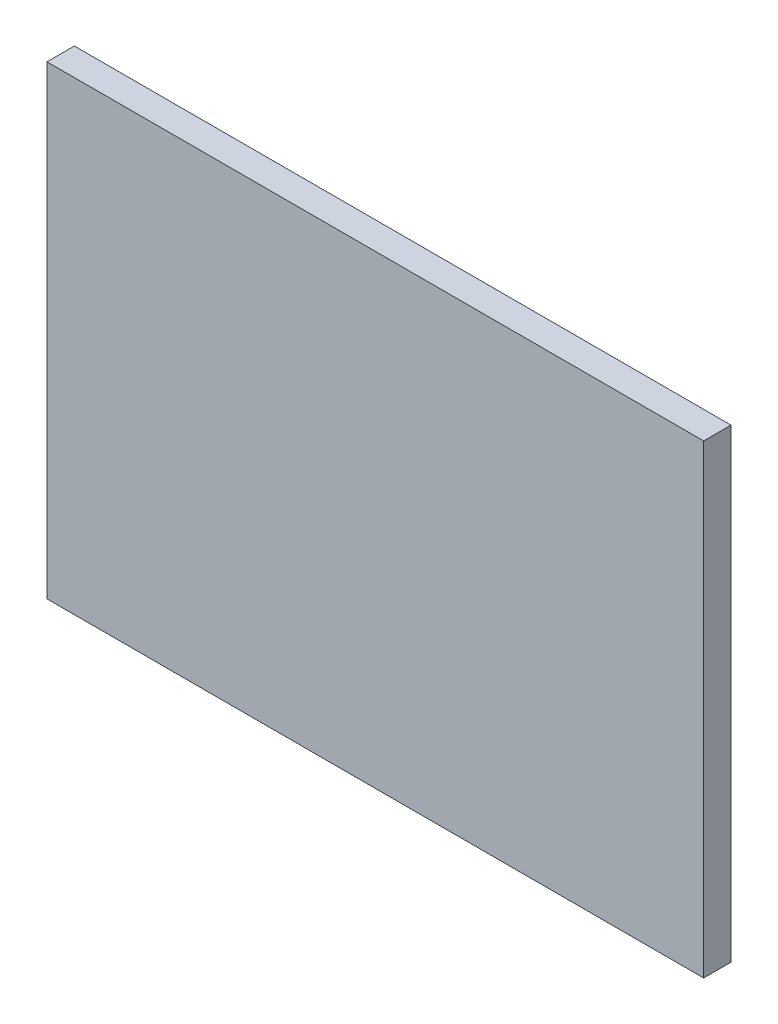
from build123d import *

# Parameters (mm, degrees)
SKETCH_1_W      = 120
SKETCH_1_H      = 85
EXTRUDE_1_DEPTH = 5


with BuildPart() as part:
    # Sketch 1 → Extrude 1 (new body)
    with BuildSketch(Plane.XY):
        Rectangle(SKETCH_1_W, SKETCH_1_H)
    extrude(amount=EXTRUDE_1_DEPTH)


solid = part.part
